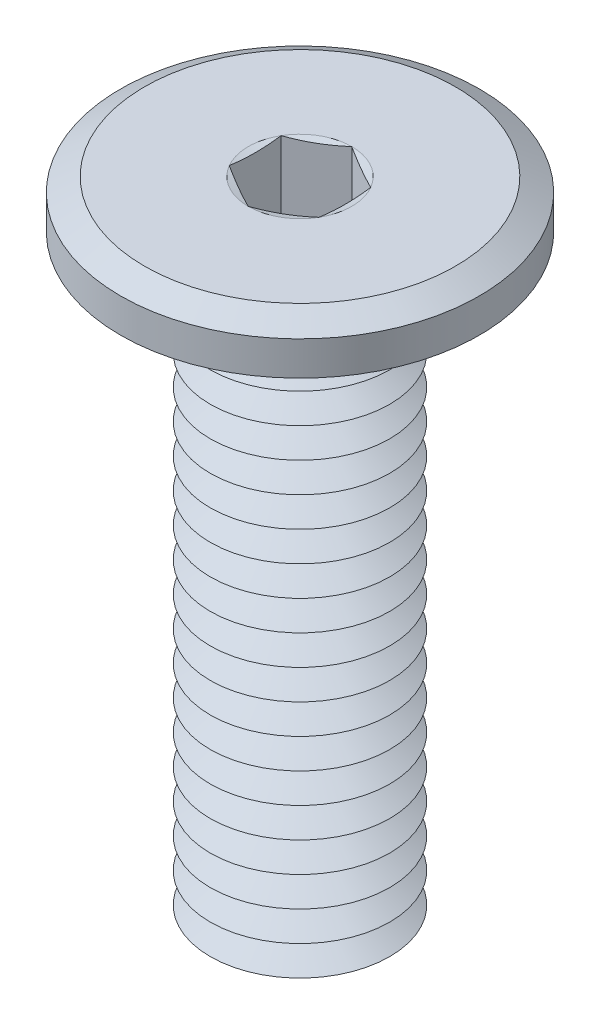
ISO-10303-21;
HEADER;
FILE_DESCRIPTION(('STEP AP214'),'2;1');
FILE_NAME('part.step','',(''),(''),'','','');
FILE_SCHEMA(('AUTOMOTIVE_DESIGN { 1 0 10303 214 1 1 1 1 }'));
ENDSEC;
DATA;
#1=APPLICATION_CONTEXT('core data for automotive mechanical design processes');
#2=APPLICATION_PROTOCOL_DEFINITION('international standard','automotive_design',2000,#1);
#3=PRODUCT_CONTEXT('',#1,'mechanical');
#4=PRODUCT('Part','Part','',(#3));
#5=PRODUCT_RELATED_PRODUCT_CATEGORY('part','',(#4));
#6=PRODUCT_DEFINITION_FORMATION('','',#4);
#7=PRODUCT_DEFINITION_CONTEXT('part definition',#1,'design');
#8=PRODUCT_DEFINITION('design','',#6,#7);
#9=PRODUCT_DEFINITION_SHAPE('','',#8);
#10=(LENGTH_UNIT() NAMED_UNIT(*) SI_UNIT(.MILLI.,.METRE.));
#11=(NAMED_UNIT(*) PLANE_ANGLE_UNIT() SI_UNIT($,.RADIAN.));
#12=(NAMED_UNIT(*) SI_UNIT($,.STERADIAN.) SOLID_ANGLE_UNIT());
#13=UNCERTAINTY_MEASURE_WITH_UNIT(LENGTH_MEASURE(1.E-05),#10,'distance_accuracy_value','');
#14=(GEOMETRIC_REPRESENTATION_CONTEXT(3) GLOBAL_UNCERTAINTY_ASSIGNED_CONTEXT((#13)) GLOBAL_UNIT_ASSIGNED_CONTEXT((#10,
#11,#12)) REPRESENTATION_CONTEXT('',''));
#15=CARTESIAN_POINT('',(0.,0.,0.));
#16=DIRECTION('',(0.,0.,1.));
#17=DIRECTION('',(1.,0.,0.));
#18=AXIS2_PLACEMENT_3D('',#15,#16,#17);
#19=CARTESIAN_POINT('',(0.,-10.05,0.));
#20=DIRECTION('',(0.,-1.,0.));
#21=DIRECTION('',(0.,0.,-1.));
#22=AXIS2_PLACEMENT_3D('',#19,#20,#21);
#23=CONICAL_SURFACE('',#22,1.5,1.0471975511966);
#24=CARTESIAN_POINT('',(0.,-9.8,0.));
#25=DIRECTION('',(0.,1.,0.));
#26=DIRECTION('',(0.,0.,1.));
#27=AXIS2_PLACEMENT_3D('',#24,#25,#26);
#28=CIRCLE('',#27,1.06698729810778);
#29=CARTESIAN_POINT('',(0.,-9.8,1.06698729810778));
#30=VERTEX_POINT('',#29);
#31=EDGE_CURVE('E505',#30,#30,#28,.T.);
#32=ORIENTED_EDGE('',*,*,#31,.F.);
#33=EDGE_LOOP('',(#32));
#34=FACE_BOUND('',#33,.T.);
#35=CARTESIAN_POINT('',(0.,-10.05,0.));
#36=DIRECTION('',(0.,1.,0.));
#37=DIRECTION('',(0.,0.,1.));
#38=AXIS2_PLACEMENT_3D('',#35,#36,#37);
#39=CIRCLE('',#38,1.5);
#40=CARTESIAN_POINT('',(0.,-10.05,1.5));
#41=VERTEX_POINT('',#40);
#42=EDGE_CURVE('E509',#41,#41,#39,.T.);
#43=ORIENTED_EDGE('',*,*,#42,.T.);
#44=EDGE_LOOP('',(#43));
#45=FACE_BOUND('',#44,.T.);
#46=ADVANCED_FACE('F39',(#34,#45),#23,.T.);
#47=CARTESIAN_POINT('',(0.,-9.8,0.));
#48=DIRECTION('',(0.,1.,0.));
#49=DIRECTION('',(0.,0.,1.));
#50=AXIS2_PLACEMENT_3D('',#47,#48,#49);
#51=CONICAL_SURFACE('',#50,1.06698729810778,1.0471975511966);
#52=CARTESIAN_POINT('',(0.,-9.55,0.));
#53=DIRECTION('',(0.,1.,0.));
#54=DIRECTION('',(0.,0.,1.));
#55=AXIS2_PLACEMENT_3D('',#52,#53,#54);
#56=CIRCLE('',#55,1.5);
#57=CARTESIAN_POINT('',(0.,-9.55,1.5));
#58=VERTEX_POINT('',#57);
#59=EDGE_CURVE('E501',#58,#58,#56,.T.);
#60=ORIENTED_EDGE('',*,*,#59,.F.);
#61=EDGE_LOOP('',(#60));
#62=FACE_BOUND('',#61,.T.);
#63=ORIENTED_EDGE('',*,*,#31,.T.);
#64=EDGE_LOOP('',(#63));
#65=FACE_BOUND('',#64,.T.);
#66=ADVANCED_FACE('F232',(#62,#65),#51,.T.);
#67=CARTESIAN_POINT('',(0.,-10.8,0.));
#68=DIRECTION('',(0.,-1.,0.));
#69=DIRECTION('',(0.,0.,-1.));
#70=AXIS2_PLACEMENT_3D('',#67,#68,#69);
#71=PLANE('',#70);
#72=CARTESIAN_POINT('',(0.,-10.8,0.));
#73=DIRECTION('',(0.,1.,0.));
#74=DIRECTION('',(0.,0.,1.));
#75=AXIS2_PLACEMENT_3D('',#72,#73,#74);
#76=CIRCLE('',#75,1.06698729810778);
#77=CARTESIAN_POINT('',(0.,-10.8,1.06698729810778));
#78=VERTEX_POINT('',#77);
#79=EDGE_CURVE('E299',#78,#78,#76,.T.);
#80=ORIENTED_EDGE('',*,*,#79,.F.);
#81=EDGE_LOOP('',(#80));
#82=FACE_BOUND('',#81,.T.);
#83=ADVANCED_FACE('F238',(#82),#71,.T.);
#84=CARTESIAN_POINT('',(0.,-10.8,0.));
#85=DIRECTION('',(0.,1.,0.));
#86=DIRECTION('',(0.,0.,1.));
#87=AXIS2_PLACEMENT_3D('',#84,#85,#86);
#88=CONICAL_SURFACE('',#87,1.06698729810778,1.0471975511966);
#89=CARTESIAN_POINT('',(0.,-10.55,0.));
#90=DIRECTION('',(0.,1.,0.));
#91=DIRECTION('',(0.,0.,1.));
#92=AXIS2_PLACEMENT_3D('',#89,#90,#91);
#93=CIRCLE('',#92,1.5);
#94=CARTESIAN_POINT('',(0.,-10.55,1.5));
#95=VERTEX_POINT('',#94);
#96=EDGE_CURVE('E517',#95,#95,#93,.T.);
#97=ORIENTED_EDGE('',*,*,#96,.F.);
#98=EDGE_LOOP('',(#97));
#99=FACE_BOUND('',#98,.T.);
#100=ORIENTED_EDGE('',*,*,#79,.T.);
#101=EDGE_LOOP('',(#100));
#102=FACE_BOUND('',#101,.T.);
#103=ADVANCED_FACE('F253',(#99,#102),#88,.T.);
#104=CARTESIAN_POINT('',(0.,-10.55,0.));
#105=DIRECTION('',(0.,-1.,0.));
#106=DIRECTION('',(0.,0.,-1.));
#107=AXIS2_PLACEMENT_3D('',#104,#105,#106);
#108=CONICAL_SURFACE('',#107,1.5,1.0471975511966);
#109=CARTESIAN_POINT('',(0.,-10.3,0.));
#110=DIRECTION('',(0.,1.,0.));
#111=DIRECTION('',(0.,0.,1.));
#112=AXIS2_PLACEMENT_3D('',#109,#110,#111);
#113=CIRCLE('',#112,1.06698729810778);
#114=CARTESIAN_POINT('',(0.,-10.3,1.06698729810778));
#115=VERTEX_POINT('',#114);
#116=EDGE_CURVE('E513',#115,#115,#113,.T.);
#117=ORIENTED_EDGE('',*,*,#116,.F.);
#118=EDGE_LOOP('',(#117));
#119=FACE_BOUND('',#118,.T.);
#120=ORIENTED_EDGE('',*,*,#96,.T.);
#121=EDGE_LOOP('',(#120));
#122=FACE_BOUND('',#121,.T.);
#123=ADVANCED_FACE('F249',(#119,#122),#108,.T.);
#124=CARTESIAN_POINT('',(0.,-10.3,0.));
#125=DIRECTION('',(0.,1.,0.));
#126=DIRECTION('',(0.,0.,1.));
#127=AXIS2_PLACEMENT_3D('',#124,#125,#126);
#128=CONICAL_SURFACE('',#127,1.06698729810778,1.0471975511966);
#129=ORIENTED_EDGE('',*,*,#42,.F.);
#130=EDGE_LOOP('',(#129));
#131=FACE_BOUND('',#130,.T.);
#132=ORIENTED_EDGE('',*,*,#116,.T.);
#133=EDGE_LOOP('',(#132));
#134=FACE_BOUND('',#133,.T.);
#135=ADVANCED_FACE('F245',(#131,#134),#128,.T.);
#136=CARTESIAN_POINT('',(0.,-9.55,0.));
#137=DIRECTION('',(0.,-1.,0.));
#138=DIRECTION('',(0.,0.,-1.));
#139=AXIS2_PLACEMENT_3D('',#136,#137,#138);
#140=CONICAL_SURFACE('',#139,1.5,1.0471975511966);
#141=CARTESIAN_POINT('',(0.,-9.3,0.));
#142=DIRECTION('',(0.,1.,0.));
#143=DIRECTION('',(0.,0.,1.));
#144=AXIS2_PLACEMENT_3D('',#141,#142,#143);
#145=CIRCLE('',#144,1.06698729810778);
#146=CARTESIAN_POINT('',(0.,-9.3,1.06698729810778));
#147=VERTEX_POINT('',#146);
#148=EDGE_CURVE('E497',#147,#147,#145,.T.);
#149=ORIENTED_EDGE('',*,*,#148,.F.);
#150=EDGE_LOOP('',(#149));
#151=FACE_BOUND('',#150,.T.);
#152=ORIENTED_EDGE('',*,*,#59,.T.);
#153=EDGE_LOOP('',(#152));
#154=FACE_BOUND('',#153,.T.);
#155=ADVANCED_FACE('F248',(#151,#154),#140,.T.);
#156=CARTESIAN_POINT('',(0.,-9.3,0.));
#157=DIRECTION('',(0.,1.,0.));
#158=DIRECTION('',(0.,0.,1.));
#159=AXIS2_PLACEMENT_3D('',#156,#157,#158);
#160=CONICAL_SURFACE('',#159,1.06698729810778,1.0471975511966);
#161=CARTESIAN_POINT('',(0.,-9.05,0.));
#162=DIRECTION('',(0.,1.,0.));
#163=DIRECTION('',(0.,0.,1.));
#164=AXIS2_PLACEMENT_3D('',#161,#162,#163);
#165=CIRCLE('',#164,1.5);
#166=CARTESIAN_POINT('',(0.,-9.05,1.5));
#167=VERTEX_POINT('',#166);
#168=EDGE_CURVE('E493',#167,#167,#165,.T.);
#169=ORIENTED_EDGE('',*,*,#168,.F.);
#170=EDGE_LOOP('',(#169));
#171=FACE_BOUND('',#170,.T.);
#172=ORIENTED_EDGE('',*,*,#148,.T.);
#173=EDGE_LOOP('',(#172));
#174=FACE_BOUND('',#173,.T.);
#175=ADVANCED_FACE('F887',(#171,#174),#160,.T.);
#176=CARTESIAN_POINT('',(0.,-9.05,0.));
#177=DIRECTION('',(0.,-1.,0.));
#178=DIRECTION('',(0.,0.,-1.));
#179=AXIS2_PLACEMENT_3D('',#176,#177,#178);
#180=CONICAL_SURFACE('',#179,1.5,1.0471975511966);
#181=CARTESIAN_POINT('',(0.,-8.8,0.));
#182=DIRECTION('',(0.,1.,0.));
#183=DIRECTION('',(0.,0.,1.));
#184=AXIS2_PLACEMENT_3D('',#181,#182,#183);
#185=CIRCLE('',#184,1.06698729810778);
#186=CARTESIAN_POINT('',(0.,-8.8,1.06698729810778));
#187=VERTEX_POINT('',#186);
#188=EDGE_CURVE('E490',#187,#187,#185,.T.);
#189=ORIENTED_EDGE('',*,*,#188,.F.);
#190=EDGE_LOOP('',(#189));
#191=FACE_BOUND('',#190,.T.);
#192=ORIENTED_EDGE('',*,*,#168,.T.);
#193=EDGE_LOOP('',(#192));
#194=FACE_BOUND('',#193,.T.);
#195=ADVANCED_FACE('F878',(#191,#194),#180,.T.);
#196=CARTESIAN_POINT('',(0.,-8.8,0.));
#197=DIRECTION('',(0.,1.,0.));
#198=DIRECTION('',(0.,0.,1.));
#199=AXIS2_PLACEMENT_3D('',#196,#197,#198);
#200=CONICAL_SURFACE('',#199,1.06698729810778,1.0471975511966);
#201=CARTESIAN_POINT('',(0.,-8.55,0.));
#202=DIRECTION('',(0.,1.,0.));
#203=DIRECTION('',(0.,0.,1.));
#204=AXIS2_PLACEMENT_3D('',#201,#202,#203);
#205=CIRCLE('',#204,1.5);
#206=CARTESIAN_POINT('',(0.,-8.55,1.5));
#207=VERTEX_POINT('',#206);
#208=EDGE_CURVE('E486',#207,#207,#205,.T.);
#209=ORIENTED_EDGE('',*,*,#208,.F.);
#210=EDGE_LOOP('',(#209));
#211=FACE_BOUND('',#210,.T.);
#212=ORIENTED_EDGE('',*,*,#188,.T.);
#213=EDGE_LOOP('',(#212));
#214=FACE_BOUND('',#213,.T.);
#215=ADVANCED_FACE('F869',(#211,#214),#200,.T.);
#216=CARTESIAN_POINT('',(0.,-8.55,0.));
#217=DIRECTION('',(0.,-1.,0.));
#218=DIRECTION('',(0.,0.,-1.));
#219=AXIS2_PLACEMENT_3D('',#216,#217,#218);
#220=CONICAL_SURFACE('',#219,1.5,1.0471975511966);
#221=CARTESIAN_POINT('',(0.,-8.3,0.));
#222=DIRECTION('',(0.,1.,0.));
#223=DIRECTION('',(0.,0.,1.));
#224=AXIS2_PLACEMENT_3D('',#221,#222,#223);
#225=CIRCLE('',#224,1.06698729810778);
#226=CARTESIAN_POINT('',(0.,-8.3,1.06698729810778));
#227=VERTEX_POINT('',#226);
#228=EDGE_CURVE('E482',#227,#227,#225,.T.);
#229=ORIENTED_EDGE('',*,*,#228,.F.);
#230=EDGE_LOOP('',(#229));
#231=FACE_BOUND('',#230,.T.);
#232=ORIENTED_EDGE('',*,*,#208,.T.);
#233=EDGE_LOOP('',(#232));
#234=FACE_BOUND('',#233,.T.);
#235=ADVANCED_FACE('F860',(#231,#234),#220,.T.);
#236=CARTESIAN_POINT('',(0.,-8.3,0.));
#237=DIRECTION('',(0.,1.,0.));
#238=DIRECTION('',(0.,0.,1.));
#239=AXIS2_PLACEMENT_3D('',#236,#237,#238);
#240=CONICAL_SURFACE('',#239,1.06698729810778,1.0471975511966);
#241=CARTESIAN_POINT('',(0.,-8.05,0.));
#242=DIRECTION('',(0.,1.,0.));
#243=DIRECTION('',(0.,0.,1.));
#244=AXIS2_PLACEMENT_3D('',#241,#242,#243);
#245=CIRCLE('',#244,1.5);
#246=CARTESIAN_POINT('',(0.,-8.05,1.5));
#247=VERTEX_POINT('',#246);
#248=EDGE_CURVE('E479',#247,#247,#245,.T.);
#249=ORIENTED_EDGE('',*,*,#248,.F.);
#250=EDGE_LOOP('',(#249));
#251=FACE_BOUND('',#250,.T.);
#252=ORIENTED_EDGE('',*,*,#228,.T.);
#253=EDGE_LOOP('',(#252));
#254=FACE_BOUND('',#253,.T.);
#255=ADVANCED_FACE('F851',(#251,#254),#240,.T.);
#256=CARTESIAN_POINT('',(0.,-8.05,0.));
#257=DIRECTION('',(0.,-1.,0.));
#258=DIRECTION('',(0.,0.,-1.));
#259=AXIS2_PLACEMENT_3D('',#256,#257,#258);
#260=CONICAL_SURFACE('',#259,1.5,1.0471975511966);
#261=CARTESIAN_POINT('',(0.,-7.8,0.));
#262=DIRECTION('',(0.,1.,0.));
#263=DIRECTION('',(0.,0.,1.));
#264=AXIS2_PLACEMENT_3D('',#261,#262,#263);
#265=CIRCLE('',#264,1.06698729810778);
#266=CARTESIAN_POINT('',(0.,-7.8,1.06698729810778));
#267=VERTEX_POINT('',#266);
#268=EDGE_CURVE('E476',#267,#267,#265,.T.);
#269=ORIENTED_EDGE('',*,*,#268,.F.);
#270=EDGE_LOOP('',(#269));
#271=FACE_BOUND('',#270,.T.);
#272=ORIENTED_EDGE('',*,*,#248,.T.);
#273=EDGE_LOOP('',(#272));
#274=FACE_BOUND('',#273,.T.);
#275=ADVANCED_FACE('F842',(#271,#274),#260,.T.);
#276=CARTESIAN_POINT('',(0.,-7.8,0.));
#277=DIRECTION('',(0.,1.,0.));
#278=DIRECTION('',(0.,0.,1.));
#279=AXIS2_PLACEMENT_3D('',#276,#277,#278);
#280=CONICAL_SURFACE('',#279,1.06698729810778,1.0471975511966);
#281=CARTESIAN_POINT('',(0.,-7.55,0.));
#282=DIRECTION('',(0.,1.,0.));
#283=DIRECTION('',(0.,0.,1.));
#284=AXIS2_PLACEMENT_3D('',#281,#282,#283);
#285=CIRCLE('',#284,1.5);
#286=CARTESIAN_POINT('',(0.,-7.55,1.5));
#287=VERTEX_POINT('',#286);
#288=EDGE_CURVE('E472',#287,#287,#285,.T.);
#289=ORIENTED_EDGE('',*,*,#288,.F.);
#290=EDGE_LOOP('',(#289));
#291=FACE_BOUND('',#290,.T.);
#292=ORIENTED_EDGE('',*,*,#268,.T.);
#293=EDGE_LOOP('',(#292));
#294=FACE_BOUND('',#293,.T.);
#295=ADVANCED_FACE('F833',(#291,#294),#280,.T.);
#296=CARTESIAN_POINT('',(0.,-7.55,0.));
#297=DIRECTION('',(0.,-1.,0.));
#298=DIRECTION('',(0.,0.,-1.));
#299=AXIS2_PLACEMENT_3D('',#296,#297,#298);
#300=CONICAL_SURFACE('',#299,1.5,1.0471975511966);
#301=CARTESIAN_POINT('',(0.,-7.3,0.));
#302=DIRECTION('',(0.,1.,0.));
#303=DIRECTION('',(0.,0.,1.));
#304=AXIS2_PLACEMENT_3D('',#301,#302,#303);
#305=CIRCLE('',#304,1.06698729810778);
#306=CARTESIAN_POINT('',(0.,-7.3,1.06698729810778));
#307=VERTEX_POINT('',#306);
#308=EDGE_CURVE('E468',#307,#307,#305,.T.);
#309=ORIENTED_EDGE('',*,*,#308,.F.);
#310=EDGE_LOOP('',(#309));
#311=FACE_BOUND('',#310,.T.);
#312=ORIENTED_EDGE('',*,*,#288,.T.);
#313=EDGE_LOOP('',(#312));
#314=FACE_BOUND('',#313,.T.);
#315=ADVANCED_FACE('F824',(#311,#314),#300,.T.);
#316=CARTESIAN_POINT('',(0.,-7.3,0.));
#317=DIRECTION('',(0.,1.,0.));
#318=DIRECTION('',(0.,0.,1.));
#319=AXIS2_PLACEMENT_3D('',#316,#317,#318);
#320=CONICAL_SURFACE('',#319,1.06698729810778,1.0471975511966);
#321=CARTESIAN_POINT('',(0.,-7.05,0.));
#322=DIRECTION('',(0.,1.,0.));
#323=DIRECTION('',(0.,0.,1.));
#324=AXIS2_PLACEMENT_3D('',#321,#322,#323);
#325=CIRCLE('',#324,1.5);
#326=CARTESIAN_POINT('',(0.,-7.05,1.5));
#327=VERTEX_POINT('',#326);
#328=EDGE_CURVE('E464',#327,#327,#325,.T.);
#329=ORIENTED_EDGE('',*,*,#328,.F.);
#330=EDGE_LOOP('',(#329));
#331=FACE_BOUND('',#330,.T.);
#332=ORIENTED_EDGE('',*,*,#308,.T.);
#333=EDGE_LOOP('',(#332));
#334=FACE_BOUND('',#333,.T.);
#335=ADVANCED_FACE('F815',(#331,#334),#320,.T.);
#336=CARTESIAN_POINT('',(0.,-7.05,0.));
#337=DIRECTION('',(0.,-1.,0.));
#338=DIRECTION('',(0.,0.,-1.));
#339=AXIS2_PLACEMENT_3D('',#336,#337,#338);
#340=CONICAL_SURFACE('',#339,1.5,1.0471975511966);
#341=CARTESIAN_POINT('',(0.,-6.8,0.));
#342=DIRECTION('',(0.,1.,0.));
#343=DIRECTION('',(0.,0.,1.));
#344=AXIS2_PLACEMENT_3D('',#341,#342,#343);
#345=CIRCLE('',#344,1.06698729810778);
#346=CARTESIAN_POINT('',(0.,-6.8,1.06698729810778));
#347=VERTEX_POINT('',#346);
#348=EDGE_CURVE('E460',#347,#347,#345,.T.);
#349=ORIENTED_EDGE('',*,*,#348,.F.);
#350=EDGE_LOOP('',(#349));
#351=FACE_BOUND('',#350,.T.);
#352=ORIENTED_EDGE('',*,*,#328,.T.);
#353=EDGE_LOOP('',(#352));
#354=FACE_BOUND('',#353,.T.);
#355=ADVANCED_FACE('F806',(#351,#354),#340,.T.);
#356=CARTESIAN_POINT('',(0.,-6.8,0.));
#357=DIRECTION('',(0.,1.,0.));
#358=DIRECTION('',(0.,0.,1.));
#359=AXIS2_PLACEMENT_3D('',#356,#357,#358);
#360=CONICAL_SURFACE('',#359,1.06698729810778,1.0471975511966);
#361=CARTESIAN_POINT('',(0.,-6.55,0.));
#362=DIRECTION('',(0.,1.,0.));
#363=DIRECTION('',(0.,0.,1.));
#364=AXIS2_PLACEMENT_3D('',#361,#362,#363);
#365=CIRCLE('',#364,1.5);
#366=CARTESIAN_POINT('',(0.,-6.55,1.5));
#367=VERTEX_POINT('',#366);
#368=EDGE_CURVE('E456',#367,#367,#365,.T.);
#369=ORIENTED_EDGE('',*,*,#368,.F.);
#370=EDGE_LOOP('',(#369));
#371=FACE_BOUND('',#370,.T.);
#372=ORIENTED_EDGE('',*,*,#348,.T.);
#373=EDGE_LOOP('',(#372));
#374=FACE_BOUND('',#373,.T.);
#375=ADVANCED_FACE('F797',(#371,#374),#360,.T.);
#376=CARTESIAN_POINT('',(0.,-6.55,0.));
#377=DIRECTION('',(0.,-1.,0.));
#378=DIRECTION('',(0.,0.,-1.));
#379=AXIS2_PLACEMENT_3D('',#376,#377,#378);
#380=CONICAL_SURFACE('',#379,1.5,1.0471975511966);
#381=CARTESIAN_POINT('',(0.,-6.3,0.));
#382=DIRECTION('',(0.,1.,0.));
#383=DIRECTION('',(0.,0.,1.));
#384=AXIS2_PLACEMENT_3D('',#381,#382,#383);
#385=CIRCLE('',#384,1.06698729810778);
#386=CARTESIAN_POINT('',(0.,-6.3,1.06698729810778));
#387=VERTEX_POINT('',#386);
#388=EDGE_CURVE('E452',#387,#387,#385,.T.);
#389=ORIENTED_EDGE('',*,*,#388,.F.);
#390=EDGE_LOOP('',(#389));
#391=FACE_BOUND('',#390,.T.);
#392=ORIENTED_EDGE('',*,*,#368,.T.);
#393=EDGE_LOOP('',(#392));
#394=FACE_BOUND('',#393,.T.);
#395=ADVANCED_FACE('F788',(#391,#394),#380,.T.);
#396=CARTESIAN_POINT('',(0.,-6.3,0.));
#397=DIRECTION('',(0.,1.,0.));
#398=DIRECTION('',(0.,0.,1.));
#399=AXIS2_PLACEMENT_3D('',#396,#397,#398);
#400=CONICAL_SURFACE('',#399,1.06698729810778,1.0471975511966);
#401=CARTESIAN_POINT('',(0.,-6.05,0.));
#402=DIRECTION('',(0.,1.,0.));
#403=DIRECTION('',(0.,0.,1.));
#404=AXIS2_PLACEMENT_3D('',#401,#402,#403);
#405=CIRCLE('',#404,1.5);
#406=CARTESIAN_POINT('',(0.,-6.05,1.5));
#407=VERTEX_POINT('',#406);
#408=EDGE_CURVE('E449',#407,#407,#405,.T.);
#409=ORIENTED_EDGE('',*,*,#408,.F.);
#410=EDGE_LOOP('',(#409));
#411=FACE_BOUND('',#410,.T.);
#412=ORIENTED_EDGE('',*,*,#388,.T.);
#413=EDGE_LOOP('',(#412));
#414=FACE_BOUND('',#413,.T.);
#415=ADVANCED_FACE('F779',(#411,#414),#400,.T.);
#416=CARTESIAN_POINT('',(0.,-6.05,0.));
#417=DIRECTION('',(0.,-1.,0.));
#418=DIRECTION('',(0.,0.,-1.));
#419=AXIS2_PLACEMENT_3D('',#416,#417,#418);
#420=CONICAL_SURFACE('',#419,1.5,1.0471975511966);
#421=CARTESIAN_POINT('',(0.,-5.8,0.));
#422=DIRECTION('',(0.,1.,0.));
#423=DIRECTION('',(0.,0.,1.));
#424=AXIS2_PLACEMENT_3D('',#421,#422,#423);
#425=CIRCLE('',#424,1.06698729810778);
#426=CARTESIAN_POINT('',(0.,-5.8,1.06698729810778));
#427=VERTEX_POINT('',#426);
#428=EDGE_CURVE('E445',#427,#427,#425,.T.);
#429=ORIENTED_EDGE('',*,*,#428,.F.);
#430=EDGE_LOOP('',(#429));
#431=FACE_BOUND('',#430,.T.);
#432=ORIENTED_EDGE('',*,*,#408,.T.);
#433=EDGE_LOOP('',(#432));
#434=FACE_BOUND('',#433,.T.);
#435=ADVANCED_FACE('F770',(#431,#434),#420,.T.);
#436=CARTESIAN_POINT('',(0.,-5.8,0.));
#437=DIRECTION('',(0.,1.,0.));
#438=DIRECTION('',(0.,0.,1.));
#439=AXIS2_PLACEMENT_3D('',#436,#437,#438);
#440=CONICAL_SURFACE('',#439,1.06698729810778,1.0471975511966);
#441=CARTESIAN_POINT('',(0.,-5.55,0.));
#442=DIRECTION('',(0.,1.,0.));
#443=DIRECTION('',(0.,0.,1.));
#444=AXIS2_PLACEMENT_3D('',#441,#442,#443);
#445=CIRCLE('',#444,1.5);
#446=CARTESIAN_POINT('',(0.,-5.55,1.5));
#447=VERTEX_POINT('',#446);
#448=EDGE_CURVE('E442',#447,#447,#445,.T.);
#449=ORIENTED_EDGE('',*,*,#448,.F.);
#450=EDGE_LOOP('',(#449));
#451=FACE_BOUND('',#450,.T.);
#452=ORIENTED_EDGE('',*,*,#428,.T.);
#453=EDGE_LOOP('',(#452));
#454=FACE_BOUND('',#453,.T.);
#455=ADVANCED_FACE('F761',(#451,#454),#440,.T.);
#456=CARTESIAN_POINT('',(0.,-5.55,0.));
#457=DIRECTION('',(0.,-1.,0.));
#458=DIRECTION('',(0.,0.,-1.));
#459=AXIS2_PLACEMENT_3D('',#456,#457,#458);
#460=CONICAL_SURFACE('',#459,1.5,1.0471975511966);
#461=CARTESIAN_POINT('',(0.,-5.3,0.));
#462=DIRECTION('',(0.,1.,0.));
#463=DIRECTION('',(0.,0.,1.));
#464=AXIS2_PLACEMENT_3D('',#461,#462,#463);
#465=CIRCLE('',#464,1.06698729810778);
#466=CARTESIAN_POINT('',(0.,-5.3,1.06698729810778));
#467=VERTEX_POINT('',#466);
#468=EDGE_CURVE('E438',#467,#467,#465,.T.);
#469=ORIENTED_EDGE('',*,*,#468,.F.);
#470=EDGE_LOOP('',(#469));
#471=FACE_BOUND('',#470,.T.);
#472=ORIENTED_EDGE('',*,*,#448,.T.);
#473=EDGE_LOOP('',(#472));
#474=FACE_BOUND('',#473,.T.);
#475=ADVANCED_FACE('F752',(#471,#474),#460,.T.);
#476=CARTESIAN_POINT('',(0.,-5.3,0.));
#477=DIRECTION('',(0.,1.,0.));
#478=DIRECTION('',(0.,0.,1.));
#479=AXIS2_PLACEMENT_3D('',#476,#477,#478);
#480=CONICAL_SURFACE('',#479,1.06698729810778,1.0471975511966);
#481=CARTESIAN_POINT('',(0.,-5.05,0.));
#482=DIRECTION('',(0.,1.,0.));
#483=DIRECTION('',(0.,0.,1.));
#484=AXIS2_PLACEMENT_3D('',#481,#482,#483);
#485=CIRCLE('',#484,1.5);
#486=CARTESIAN_POINT('',(0.,-5.05,1.5));
#487=VERTEX_POINT('',#486);
#488=EDGE_CURVE('E434',#487,#487,#485,.T.);
#489=ORIENTED_EDGE('',*,*,#488,.F.);
#490=EDGE_LOOP('',(#489));
#491=FACE_BOUND('',#490,.T.);
#492=ORIENTED_EDGE('',*,*,#468,.T.);
#493=EDGE_LOOP('',(#492));
#494=FACE_BOUND('',#493,.T.);
#495=ADVANCED_FACE('F743',(#491,#494),#480,.T.);
#496=CARTESIAN_POINT('',(0.,-5.05,0.));
#497=DIRECTION('',(0.,-1.,0.));
#498=DIRECTION('',(0.,0.,-1.));
#499=AXIS2_PLACEMENT_3D('',#496,#497,#498);
#500=CONICAL_SURFACE('',#499,1.5,1.0471975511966);
#501=CARTESIAN_POINT('',(0.,-4.8,0.));
#502=DIRECTION('',(0.,1.,0.));
#503=DIRECTION('',(0.,0.,1.));
#504=AXIS2_PLACEMENT_3D('',#501,#502,#503);
#505=CIRCLE('',#504,1.06698729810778);
#506=CARTESIAN_POINT('',(0.,-4.8,1.06698729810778));
#507=VERTEX_POINT('',#506);
#508=EDGE_CURVE('E430',#507,#507,#505,.T.);
#509=ORIENTED_EDGE('',*,*,#508,.F.);
#510=EDGE_LOOP('',(#509));
#511=FACE_BOUND('',#510,.T.);
#512=ORIENTED_EDGE('',*,*,#488,.T.);
#513=EDGE_LOOP('',(#512));
#514=FACE_BOUND('',#513,.T.);
#515=ADVANCED_FACE('F734',(#511,#514),#500,.T.);
#516=CARTESIAN_POINT('',(0.,-4.8,0.));
#517=DIRECTION('',(0.,1.,0.));
#518=DIRECTION('',(0.,0.,1.));
#519=AXIS2_PLACEMENT_3D('',#516,#517,#518);
#520=CONICAL_SURFACE('',#519,1.06698729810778,1.0471975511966);
#521=CARTESIAN_POINT('',(0.,-4.55,0.));
#522=DIRECTION('',(0.,1.,0.));
#523=DIRECTION('',(0.,0.,1.));
#524=AXIS2_PLACEMENT_3D('',#521,#522,#523);
#525=CIRCLE('',#524,1.5);
#526=CARTESIAN_POINT('',(0.,-4.55,1.5));
#527=VERTEX_POINT('',#526);
#528=EDGE_CURVE('E426',#527,#527,#525,.T.);
#529=ORIENTED_EDGE('',*,*,#528,.F.);
#530=EDGE_LOOP('',(#529));
#531=FACE_BOUND('',#530,.T.);
#532=ORIENTED_EDGE('',*,*,#508,.T.);
#533=EDGE_LOOP('',(#532));
#534=FACE_BOUND('',#533,.T.);
#535=ADVANCED_FACE('F725',(#531,#534),#520,.T.);
#536=CARTESIAN_POINT('',(0.,-4.55,0.));
#537=DIRECTION('',(0.,-1.,0.));
#538=DIRECTION('',(0.,0.,-1.));
#539=AXIS2_PLACEMENT_3D('',#536,#537,#538);
#540=CONICAL_SURFACE('',#539,1.5,1.0471975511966);
#541=CARTESIAN_POINT('',(0.,-4.3,0.));
#542=DIRECTION('',(0.,1.,0.));
#543=DIRECTION('',(0.,0.,1.));
#544=AXIS2_PLACEMENT_3D('',#541,#542,#543);
#545=CIRCLE('',#544,1.06698729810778);
#546=CARTESIAN_POINT('',(0.,-4.3,1.06698729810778));
#547=VERTEX_POINT('',#546);
#548=EDGE_CURVE('E422',#547,#547,#545,.T.);
#549=ORIENTED_EDGE('',*,*,#548,.F.);
#550=EDGE_LOOP('',(#549));
#551=FACE_BOUND('',#550,.T.);
#552=ORIENTED_EDGE('',*,*,#528,.T.);
#553=EDGE_LOOP('',(#552));
#554=FACE_BOUND('',#553,.T.);
#555=ADVANCED_FACE('F716',(#551,#554),#540,.T.);
#556=CARTESIAN_POINT('',(0.,-4.3,0.));
#557=DIRECTION('',(0.,1.,0.));
#558=DIRECTION('',(0.,0.,1.));
#559=AXIS2_PLACEMENT_3D('',#556,#557,#558);
#560=CONICAL_SURFACE('',#559,1.06698729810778,1.0471975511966);
#561=CARTESIAN_POINT('',(0.,-4.05,0.));
#562=DIRECTION('',(0.,1.,0.));
#563=DIRECTION('',(0.,0.,1.));
#564=AXIS2_PLACEMENT_3D('',#561,#562,#563);
#565=CIRCLE('',#564,1.5);
#566=CARTESIAN_POINT('',(0.,-4.05,1.5));
#567=VERTEX_POINT('',#566);
#568=EDGE_CURVE('E418',#567,#567,#565,.T.);
#569=ORIENTED_EDGE('',*,*,#568,.F.);
#570=EDGE_LOOP('',(#569));
#571=FACE_BOUND('',#570,.T.);
#572=ORIENTED_EDGE('',*,*,#548,.T.);
#573=EDGE_LOOP('',(#572));
#574=FACE_BOUND('',#573,.T.);
#575=ADVANCED_FACE('F707',(#571,#574),#560,.T.);
#576=CARTESIAN_POINT('',(0.,-4.05,0.));
#577=DIRECTION('',(0.,-1.,0.));
#578=DIRECTION('',(0.,0.,-1.));
#579=AXIS2_PLACEMENT_3D('',#576,#577,#578);
#580=CONICAL_SURFACE('',#579,1.5,1.0471975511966);
#581=CARTESIAN_POINT('',(0.,-3.8,0.));
#582=DIRECTION('',(0.,1.,0.));
#583=DIRECTION('',(0.,0.,1.));
#584=AXIS2_PLACEMENT_3D('',#581,#582,#583);
#585=CIRCLE('',#584,1.06698729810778);
#586=CARTESIAN_POINT('',(0.,-3.8,1.06698729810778));
#587=VERTEX_POINT('',#586);
#588=EDGE_CURVE('E414',#587,#587,#585,.T.);
#589=ORIENTED_EDGE('',*,*,#588,.F.);
#590=EDGE_LOOP('',(#589));
#591=FACE_BOUND('',#590,.T.);
#592=ORIENTED_EDGE('',*,*,#568,.T.);
#593=EDGE_LOOP('',(#592));
#594=FACE_BOUND('',#593,.T.);
#595=ADVANCED_FACE('F698',(#591,#594),#580,.T.);
#596=CARTESIAN_POINT('',(0.,-3.8,0.));
#597=DIRECTION('',(0.,1.,0.));
#598=DIRECTION('',(0.,0.,1.));
#599=AXIS2_PLACEMENT_3D('',#596,#597,#598);
#600=CONICAL_SURFACE('',#599,1.06698729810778,1.0471975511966);
#601=CARTESIAN_POINT('',(0.,-3.55,0.));
#602=DIRECTION('',(0.,1.,0.));
#603=DIRECTION('',(0.,0.,1.));
#604=AXIS2_PLACEMENT_3D('',#601,#602,#603);
#605=CIRCLE('',#604,1.5);
#606=CARTESIAN_POINT('',(0.,-3.55,1.5));
#607=VERTEX_POINT('',#606);
#608=EDGE_CURVE('E410',#607,#607,#605,.T.);
#609=ORIENTED_EDGE('',*,*,#608,.F.);
#610=EDGE_LOOP('',(#609));
#611=FACE_BOUND('',#610,.T.);
#612=ORIENTED_EDGE('',*,*,#588,.T.);
#613=EDGE_LOOP('',(#612));
#614=FACE_BOUND('',#613,.T.);
#615=ADVANCED_FACE('F689',(#611,#614),#600,.T.);
#616=CARTESIAN_POINT('',(0.,-3.55,0.));
#617=DIRECTION('',(0.,-1.,0.));
#618=DIRECTION('',(0.,0.,-1.));
#619=AXIS2_PLACEMENT_3D('',#616,#617,#618);
#620=CONICAL_SURFACE('',#619,1.5,1.0471975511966);
#621=CARTESIAN_POINT('',(0.,-3.3,0.));
#622=DIRECTION('',(0.,1.,0.));
#623=DIRECTION('',(0.,0.,1.));
#624=AXIS2_PLACEMENT_3D('',#621,#622,#623);
#625=CIRCLE('',#624,1.06698729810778);
#626=CARTESIAN_POINT('',(0.,-3.3,1.06698729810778));
#627=VERTEX_POINT('',#626);
#628=EDGE_CURVE('E406',#627,#627,#625,.T.);
#629=ORIENTED_EDGE('',*,*,#628,.F.);
#630=EDGE_LOOP('',(#629));
#631=FACE_BOUND('',#630,.T.);
#632=ORIENTED_EDGE('',*,*,#608,.T.);
#633=EDGE_LOOP('',(#632));
#634=FACE_BOUND('',#633,.T.);
#635=ADVANCED_FACE('F680',(#631,#634),#620,.T.);
#636=CARTESIAN_POINT('',(0.,-3.3,0.));
#637=DIRECTION('',(0.,1.,0.));
#638=DIRECTION('',(0.,0.,1.));
#639=AXIS2_PLACEMENT_3D('',#636,#637,#638);
#640=CONICAL_SURFACE('',#639,1.06698729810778,1.0471975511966);
#641=CARTESIAN_POINT('',(0.,-3.05,0.));
#642=DIRECTION('',(0.,1.,0.));
#643=DIRECTION('',(0.,0.,1.));
#644=AXIS2_PLACEMENT_3D('',#641,#642,#643);
#645=CIRCLE('',#644,1.5);
#646=CARTESIAN_POINT('',(0.,-3.05,1.5));
#647=VERTEX_POINT('',#646);
#648=EDGE_CURVE('E402',#647,#647,#645,.T.);
#649=ORIENTED_EDGE('',*,*,#648,.F.);
#650=EDGE_LOOP('',(#649));
#651=FACE_BOUND('',#650,.T.);
#652=ORIENTED_EDGE('',*,*,#628,.T.);
#653=EDGE_LOOP('',(#652));
#654=FACE_BOUND('',#653,.T.);
#655=ADVANCED_FACE('F671',(#651,#654),#640,.T.);
#656=CARTESIAN_POINT('',(0.,-3.05,0.));
#657=DIRECTION('',(0.,-1.,0.));
#658=DIRECTION('',(0.,0.,-1.));
#659=AXIS2_PLACEMENT_3D('',#656,#657,#658);
#660=CONICAL_SURFACE('',#659,1.5,1.0471975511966);
#661=CARTESIAN_POINT('',(0.,-2.8,0.));
#662=DIRECTION('',(0.,1.,0.));
#663=DIRECTION('',(0.,0.,1.));
#664=AXIS2_PLACEMENT_3D('',#661,#662,#663);
#665=CIRCLE('',#664,1.06698729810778);
#666=CARTESIAN_POINT('',(0.,-2.8,1.06698729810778));
#667=VERTEX_POINT('',#666);
#668=EDGE_CURVE('E398',#667,#667,#665,.T.);
#669=ORIENTED_EDGE('',*,*,#668,.F.);
#670=EDGE_LOOP('',(#669));
#671=FACE_BOUND('',#670,.T.);
#672=ORIENTED_EDGE('',*,*,#648,.T.);
#673=EDGE_LOOP('',(#672));
#674=FACE_BOUND('',#673,.T.);
#675=ADVANCED_FACE('F662',(#671,#674),#660,.T.);
#676=CARTESIAN_POINT('',(0.,-2.8,0.));
#677=DIRECTION('',(0.,1.,0.));
#678=DIRECTION('',(0.,0.,1.));
#679=AXIS2_PLACEMENT_3D('',#676,#677,#678);
#680=CONICAL_SURFACE('',#679,1.06698729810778,1.0471975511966);
#681=CARTESIAN_POINT('',(0.,-2.55,0.));
#682=DIRECTION('',(0.,1.,0.));
#683=DIRECTION('',(0.,0.,1.));
#684=AXIS2_PLACEMENT_3D('',#681,#682,#683);
#685=CIRCLE('',#684,1.5);
#686=CARTESIAN_POINT('',(0.,-2.55,1.5));
#687=VERTEX_POINT('',#686);
#688=EDGE_CURVE('E394',#687,#687,#685,.T.);
#689=ORIENTED_EDGE('',*,*,#688,.F.);
#690=EDGE_LOOP('',(#689));
#691=FACE_BOUND('',#690,.T.);
#692=ORIENTED_EDGE('',*,*,#668,.T.);
#693=EDGE_LOOP('',(#692));
#694=FACE_BOUND('',#693,.T.);
#695=ADVANCED_FACE('F653',(#691,#694),#680,.T.);
#696=CARTESIAN_POINT('',(0.,-2.55,0.));
#697=DIRECTION('',(0.,-1.,0.));
#698=DIRECTION('',(0.,0.,-1.));
#699=AXIS2_PLACEMENT_3D('',#696,#697,#698);
#700=CONICAL_SURFACE('',#699,1.5,1.0471975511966);
#701=CARTESIAN_POINT('',(0.,-2.3,0.));
#702=DIRECTION('',(0.,1.,0.));
#703=DIRECTION('',(0.,0.,1.));
#704=AXIS2_PLACEMENT_3D('',#701,#702,#703);
#705=CIRCLE('',#704,1.06698729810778);
#706=CARTESIAN_POINT('',(0.,-2.3,1.06698729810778));
#707=VERTEX_POINT('',#706);
#708=EDGE_CURVE('E390',#707,#707,#705,.T.);
#709=ORIENTED_EDGE('',*,*,#708,.F.);
#710=EDGE_LOOP('',(#709));
#711=FACE_BOUND('',#710,.T.);
#712=ORIENTED_EDGE('',*,*,#688,.T.);
#713=EDGE_LOOP('',(#712));
#714=FACE_BOUND('',#713,.T.);
#715=ADVANCED_FACE('F644',(#711,#714),#700,.T.);
#716=CARTESIAN_POINT('',(0.,-2.3,0.));
#717=DIRECTION('',(0.,1.,0.));
#718=DIRECTION('',(0.,0.,1.));
#719=AXIS2_PLACEMENT_3D('',#716,#717,#718);
#720=CONICAL_SURFACE('',#719,1.06698729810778,1.0471975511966);
#721=CARTESIAN_POINT('',(0.,-2.05,0.));
#722=DIRECTION('',(0.,1.,0.));
#723=DIRECTION('',(0.,0.,1.));
#724=AXIS2_PLACEMENT_3D('',#721,#722,#723);
#725=CIRCLE('',#724,1.5);
#726=CARTESIAN_POINT('',(0.,-2.05,1.5));
#727=VERTEX_POINT('',#726);
#728=EDGE_CURVE('E386',#727,#727,#725,.T.);
#729=ORIENTED_EDGE('',*,*,#728,.F.);
#730=EDGE_LOOP('',(#729));
#731=FACE_BOUND('',#730,.T.);
#732=ORIENTED_EDGE('',*,*,#708,.T.);
#733=EDGE_LOOP('',(#732));
#734=FACE_BOUND('',#733,.T.);
#735=ADVANCED_FACE('F635',(#731,#734),#720,.T.);
#736=CARTESIAN_POINT('',(0.,-2.05,0.));
#737=DIRECTION('',(0.,-1.,0.));
#738=DIRECTION('',(0.,0.,-1.));
#739=AXIS2_PLACEMENT_3D('',#736,#737,#738);
#740=CONICAL_SURFACE('',#739,1.5,1.0471975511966);
#741=CARTESIAN_POINT('',(0.,-1.8,0.));
#742=DIRECTION('',(0.,1.,0.));
#743=DIRECTION('',(0.,0.,1.));
#744=AXIS2_PLACEMENT_3D('',#741,#742,#743);
#745=CIRCLE('',#744,1.06698729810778);
#746=CARTESIAN_POINT('',(0.,-1.8,1.06698729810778));
#747=VERTEX_POINT('',#746);
#748=EDGE_CURVE('E382',#747,#747,#745,.T.);
#749=ORIENTED_EDGE('',*,*,#748,.F.);
#750=EDGE_LOOP('',(#749));
#751=FACE_BOUND('',#750,.T.);
#752=ORIENTED_EDGE('',*,*,#728,.T.);
#753=EDGE_LOOP('',(#752));
#754=FACE_BOUND('',#753,.T.);
#755=ADVANCED_FACE('F626',(#751,#754),#740,.T.);
#756=CARTESIAN_POINT('',(0.,-1.8,0.));
#757=DIRECTION('',(0.,1.,0.));
#758=DIRECTION('',(0.,0.,1.));
#759=AXIS2_PLACEMENT_3D('',#756,#757,#758);
#760=CONICAL_SURFACE('',#759,1.06698729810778,1.0471975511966);
#761=CARTESIAN_POINT('',(0.,-1.55,0.));
#762=DIRECTION('',(0.,1.,0.));
#763=DIRECTION('',(0.,0.,1.));
#764=AXIS2_PLACEMENT_3D('',#761,#762,#763);
#765=CIRCLE('',#764,1.5);
#766=CARTESIAN_POINT('',(0.,-1.55,1.5));
#767=VERTEX_POINT('',#766);
#768=EDGE_CURVE('E366',#767,#767,#765,.T.);
#769=ORIENTED_EDGE('',*,*,#768,.F.);
#770=EDGE_LOOP('',(#769));
#771=FACE_BOUND('',#770,.T.);
#772=ORIENTED_EDGE('',*,*,#748,.T.);
#773=EDGE_LOOP('',(#772));
#774=FACE_BOUND('',#773,.T.);
#775=ADVANCED_FACE('F273',(#771,#774),#760,.T.);
#776=CARTESIAN_POINT('',(0.,0.,0.));
#777=DIRECTION('',(0.,1.,0.));
#778=DIRECTION('',(0.,0.,1.));
#779=AXIS2_PLACEMENT_3D('',#776,#777,#778);
#780=PLANE('',#779);
#781=CARTESIAN_POINT('',(0.,0.,0.));
#782=DIRECTION('',(0.,1.,0.));
#783=DIRECTION('',(0.,0.,1.));
#784=AXIS2_PLACEMENT_3D('',#781,#782,#783);
#785=CIRCLE('',#784,0.866025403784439);
#786=CARTESIAN_POINT('',(0.,0.,0.866025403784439));
#787=VERTEX_POINT('',#786);
#788=CARTESIAN_POINT('',(0.75,0.,0.43301270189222));
#789=VERTEX_POINT('',#788);
#790=EDGE_CURVE('E66',#787,#789,#785,.T.);
#791=ORIENTED_EDGE('',*,*,#790,.F.);
#792=CARTESIAN_POINT('',(-0.75,0.,0.433012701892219));
#793=VERTEX_POINT('',#792);
#794=EDGE_CURVE('E168',#793,#787,#785,.T.);
#795=ORIENTED_EDGE('',*,*,#794,.F.);
#796=CARTESIAN_POINT('',(-0.75,0.,-0.43301270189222));
#797=VERTEX_POINT('',#796);
#798=EDGE_CURVE('E164',#797,#793,#785,.T.);
#799=ORIENTED_EDGE('',*,*,#798,.F.);
#800=CARTESIAN_POINT('',(0.,0.,-0.866025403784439));
#801=VERTEX_POINT('',#800);
#802=EDGE_CURVE('E128',#801,#797,#785,.T.);
#803=ORIENTED_EDGE('',*,*,#802,.F.);
#804=CARTESIAN_POINT('',(0.75,0.,-0.43301270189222));
#805=VERTEX_POINT('',#804);
#806=EDGE_CURVE('E119',#805,#801,#785,.T.);
#807=ORIENTED_EDGE('',*,*,#806,.F.);
#808=EDGE_CURVE('E59',#789,#805,#785,.T.);
#809=ORIENTED_EDGE('',*,*,#808,.F.);
#810=EDGE_LOOP('',(#791,#795,#799,#803,#807,#809));
#811=FACE_BOUND('',#810,.T.);
#812=CARTESIAN_POINT('',(0.,0.,0.));
#813=DIRECTION('',(0.,1.,0.));
#814=DIRECTION('',(0.,0.,1.));
#815=AXIS2_PLACEMENT_3D('',#812,#813,#814);
#816=CIRCLE('',#815,2.59999999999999);
#817=CARTESIAN_POINT('',(0.,0.,2.59999999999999));
#818=VERTEX_POINT('',#817);
#819=EDGE_CURVE('E295',#818,#818,#816,.T.);
#820=ORIENTED_EDGE('',*,*,#819,.T.);
#821=EDGE_LOOP('',(#820));
#822=FACE_BOUND('',#821,.T.);
#823=ADVANCED_FACE('F160',(#811,#822),#780,.T.);
#824=CARTESIAN_POINT('',(0.,-0.8,0.));
#825=DIRECTION('',(0.,1.,0.));
#826=DIRECTION('',(0.,0.,1.));
#827=AXIS2_PLACEMENT_3D('',#824,#825,#826);
#828=CYLINDRICAL_SURFACE('',#827,3.);
#829=CARTESIAN_POINT('',(0.,-0.230940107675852,0.));
#830=DIRECTION('',(0.,1.,0.));
#831=DIRECTION('',(0.,0.,1.));
#832=AXIS2_PLACEMENT_3D('',#829,#830,#831);
#833=CIRCLE('',#832,3.);
#834=CARTESIAN_POINT('',(0.,-0.230940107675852,3.));
#835=VERTEX_POINT('',#834);
#836=EDGE_CURVE('E305',#835,#835,#833,.F.);
#837=ORIENTED_EDGE('',*,*,#836,.T.);
#838=EDGE_LOOP('',(#837));
#839=FACE_BOUND('',#838,.T.);
#840=CARTESIAN_POINT('',(0.,-0.8,0.));
#841=DIRECTION('',(0.,1.,0.));
#842=DIRECTION('',(0.,0.,1.));
#843=AXIS2_PLACEMENT_3D('',#840,#841,#842);
#844=CIRCLE('',#843,3.);
#845=CARTESIAN_POINT('',(0.,-0.8,3.));
#846=VERTEX_POINT('',#845);
#847=EDGE_CURVE('E290',#846,#846,#844,.T.);
#848=ORIENTED_EDGE('',*,*,#847,.T.);
#849=EDGE_LOOP('',(#848));
#850=FACE_BOUND('',#849,.T.);
#851=ADVANCED_FACE('F269',(#839,#850),#828,.T.);
#852=CARTESIAN_POINT('',(0.,-0.8,0.));
#853=DIRECTION('',(0.,1.,0.));
#854=DIRECTION('',(0.,0.,1.));
#855=AXIS2_PLACEMENT_3D('',#852,#853,#854);
#856=PLANE('',#855);
#857=CARTESIAN_POINT('',(0.,-0.8,0.));
#858=DIRECTION('',(0.,1.,0.));
#859=DIRECTION('',(0.,0.,1.));
#860=AXIS2_PLACEMENT_3D('',#857,#858,#859);
#861=CIRCLE('',#860,1.6);
#862=CARTESIAN_POINT('',(0.,-0.8,1.6));
#863=VERTEX_POINT('',#862);
#864=EDGE_CURVE('E285',#863,#863,#861,.T.);
#865=ORIENTED_EDGE('',*,*,#864,.T.);
#866=EDGE_LOOP('',(#865));
#867=FACE_BOUND('',#866,.T.);
#868=ORIENTED_EDGE('',*,*,#847,.F.);
#869=EDGE_LOOP('',(#868));
#870=FACE_BOUND('',#869,.T.);
#871=ADVANCED_FACE('F265',(#867,#870),#856,.F.);
#872=CARTESIAN_POINT('',(0.,-10.8,0.));
#873=DIRECTION('',(0.,1.,0.));
#874=DIRECTION('',(0.,0.,1.));
#875=AXIS2_PLACEMENT_3D('',#872,#873,#874);
#876=CYLINDRICAL_SURFACE('',#875,1.5);
#877=CARTESIAN_POINT('',(0.,-0.9,0.));
#878=DIRECTION('',(0.,1.,0.));
#879=DIRECTION('',(0.,0.,1.));
#880=AXIS2_PLACEMENT_3D('',#877,#878,#879);
#881=CIRCLE('',#880,1.5);
#882=CARTESIAN_POINT('',(0.,-0.9,1.5));
#883=VERTEX_POINT('',#882);
#884=EDGE_CURVE('E288',#883,#883,#881,.F.);
#885=ORIENTED_EDGE('',*,*,#884,.T.);
#886=EDGE_LOOP('',(#885));
#887=FACE_BOUND('',#886,.T.);
#888=ORIENTED_EDGE('',*,*,#768,.T.);
#889=EDGE_LOOP('',(#888));
#890=FACE_BOUND('',#889,.T.);
#891=ADVANCED_FACE('F261',(#887,#890),#876,.T.);
#892=CARTESIAN_POINT('',(0.,-0.9,0.));
#893=DIRECTION('',(0.,1.,0.));
#894=DIRECTION('',(0.,0.,1.));
#895=AXIS2_PLACEMENT_3D('',#892,#893,#894);
#896=TOROIDAL_SURFACE('',#895,1.6,0.1);
#897=ORIENTED_EDGE('',*,*,#864,.F.);
#898=EDGE_LOOP('',(#897));
#899=FACE_BOUND('',#898,.T.);
#900=ORIENTED_EDGE('',*,*,#884,.F.);
#901=EDGE_LOOP('',(#900));
#902=FACE_BOUND('',#901,.T.);
#903=ADVANCED_FACE('F264',(#899,#902),#896,.F.);
#904=CARTESIAN_POINT('',(0.,0.,0.));
#905=DIRECTION('',(0.,-1.,0.));
#906=DIRECTION('',(0.,0.,-1.));
#907=AXIS2_PLACEMENT_3D('',#904,#905,#906);
#908=CONICAL_SURFACE('',#907,2.59999999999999,1.0471975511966);
#909=ORIENTED_EDGE('',*,*,#836,.F.);
#910=EDGE_LOOP('',(#909));
#911=FACE_BOUND('',#910,.T.);
#912=ORIENTED_EDGE('',*,*,#819,.F.);
#913=EDGE_LOOP('',(#912));
#914=FACE_BOUND('',#913,.T.);
#915=ADVANCED_FACE('F41',(#911,#914),#908,.T.);
#916=CARTESIAN_POINT('',(0.,0.,0.));
#917=DIRECTION('',(0.,1.,0.));
#918=DIRECTION('',(0.,0.,1.));
#919=AXIS2_PLACEMENT_3D('',#916,#917,#918);
#920=CONICAL_SURFACE('',#919,0.866025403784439,1.30899693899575);
#921=ORIENTED_EDGE('',*,*,#802,.T.);
#922=CARTESIAN_POINT('',(0.00020000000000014,3.0946294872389E-05,-0.866140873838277));
#923=CARTESIAN_POINT('',(-0.0309621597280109,-0.00479360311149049,-0.84814939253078));
#924=CARTESIAN_POINT('',(-0.0621808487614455,-0.00917362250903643,-0.830125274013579));
#925=CARTESIAN_POINT('',(-0.124728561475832,-0.0168690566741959,-0.794013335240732));
#926=CARTESIAN_POINT('',(-0.156057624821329,-0.0201840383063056,-0.775925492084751));
#927=CARTESIAN_POINT('',(-0.21863598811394,-0.0255557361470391,-0.739795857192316));
#928=CARTESIAN_POINT('',(-0.2498848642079,-0.0276188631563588,-0.721754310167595));
#929=CARTESIAN_POINT('',(-0.312422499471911,-0.0303853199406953,-0.685648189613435));
#930=CARTESIAN_POINT('',(-0.343711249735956,-0.0310889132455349,-0.667583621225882));
#931=CARTESIAN_POINT('',(-0.406288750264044,-0.0310889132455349,-0.631454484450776));
#932=CARTESIAN_POINT('',(-0.437577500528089,-0.0303853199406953,-0.613389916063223));
#933=CARTESIAN_POINT('',(-0.5001151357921,-0.0276188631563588,-0.577283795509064));
#934=CARTESIAN_POINT('',(-0.53136401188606,-0.0255557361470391,-0.559242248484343));
#935=CARTESIAN_POINT('',(-0.593942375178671,-0.0201840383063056,-0.523112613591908));
#936=CARTESIAN_POINT('',(-0.625271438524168,-0.0168690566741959,-0.505024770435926));
#937=CARTESIAN_POINT('',(-0.687819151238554,-0.00917362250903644,-0.46891283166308));
#938=CARTESIAN_POINT('',(-0.719037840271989,-0.0047936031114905,-0.450888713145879));
#939=CARTESIAN_POINT('',(-0.7502,3.09462948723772E-05,-0.432897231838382));
#940=B_SPLINE_CURVE_WITH_KNOTS('',3,(#922,#923,#924,#925,#926,#927,#928,#929,#930,#931,#932,
#933,#934,#935,#936,#937,#938,#939),.UNSPECIFIED.,.F.,.F.,(4,2,2,2,2,2,2,2,4),(0.,
0.108920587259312,0.217885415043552,0.326287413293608,0.434668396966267,0.543049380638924,
0.651451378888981,0.760416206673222,0.869336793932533),.UNSPECIFIED.);
#941=EDGE_CURVE('E11',#801,#797,#940,.T.);
#942=ORIENTED_EDGE('',*,*,#941,.F.);
#943=EDGE_LOOP('',(#921,#942));
#944=FACE_BOUND('',#943,.T.);
#945=ADVANCED_FACE('F132',(#944),#920,.F.);
#946=ORIENTED_EDGE('',*,*,#798,.T.);
#947=CARTESIAN_POINT('',(-0.75,0.177029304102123,-1.32978817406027));
#948=CARTESIAN_POINT('',(-0.75,0.162091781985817,-1.26569678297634));
#949=CARTESIAN_POINT('',(-0.75,0.147363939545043,-1.20155322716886));
#950=CARTESIAN_POINT('',(-0.75,0.118617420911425,-1.07309552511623));
#951=CARTESIAN_POINT('',(-0.75,0.10459887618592,-1.00878134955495));
#952=CARTESIAN_POINT('',(-0.75,0.0774349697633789,-0.879312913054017));
#953=CARTESIAN_POINT('',(-0.75,0.0642994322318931,-0.814156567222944));
#954=CARTESIAN_POINT('',(-0.75,0.0395688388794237,-0.683540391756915));
#955=CARTESIAN_POINT('',(-0.75,0.0279739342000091,-0.618080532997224));
#956=CARTESIAN_POINT('',(-0.75,0.00739697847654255,-0.488585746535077));
#957=CARTESIAN_POINT('',(-0.75,-0.00164814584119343,-0.424561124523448));
#958=CARTESIAN_POINT('',(-0.75,-0.0165441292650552,-0.296144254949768));
#959=CARTESIAN_POINT('',(-0.75,-0.022396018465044,-0.231752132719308));
#960=CARTESIAN_POINT('',(-0.75,-0.0298945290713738,-0.103003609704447));
#961=CARTESIAN_POINT('',(-0.75,-0.0315603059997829,-0.0386483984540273));
#962=CARTESIAN_POINT('',(-0.75,-0.0303818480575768,0.0900234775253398));
#963=CARTESIAN_POINT('',(-0.75,-0.0275372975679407,0.154340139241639));
#964=CARTESIAN_POINT('',(-0.75,-0.0192590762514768,0.264921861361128));
#965=CARTESIAN_POINT('',(-0.75,-0.0147584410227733,0.311262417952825));
#966=CARTESIAN_POINT('',(-0.75,-0.00409265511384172,0.403747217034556));
#967=CARTESIAN_POINT('',(-0.75,0.00207245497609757,0.449891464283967));
#968=CARTESIAN_POINT('',(-0.75,0.0225208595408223,0.588341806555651));
#969=CARTESIAN_POINT('',(-0.75,0.0387292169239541,0.680359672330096));
#970=CARTESIAN_POINT('',(-0.75,0.06537279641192,0.818919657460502));
#971=CARTESIAN_POINT('',(-0.75,0.0747513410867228,0.865678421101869));
#972=CARTESIAN_POINT('',(-0.75,0.0940825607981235,0.959079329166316));
#973=CARTESIAN_POINT('',(-0.75,0.104035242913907,1.00572147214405));
#974=CARTESIAN_POINT('',(-0.75,0.124311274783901,1.09864456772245));
#975=CARTESIAN_POINT('',(-0.75,0.134632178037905,1.14492606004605));
#976=CARTESIAN_POINT('',(-0.75,0.155605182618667,1.23741055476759));
#977=CARTESIAN_POINT('',(-0.75,0.166257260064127,1.28361356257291));
#978=CARTESIAN_POINT('',(-0.75,0.177029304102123,1.32978817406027));
#979=B_SPLINE_CURVE_WITH_KNOTS('',3,(#947,#948,#949,#950,#951,#952,#953,#954,#955,#956,#957,
#958,#959,#960,#961,#962,#963,#964,#965,#966,#967,#968,#969,#970,#971,#972,#973,#974,#975,#976,
#977,#978),.UNSPECIFIED.,.F.,.F.,(4,2,2,2,2,2,2,2,2,2,2,2,2,2,2,4),(0.,0.197431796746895,
0.394900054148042,0.594289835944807,0.793699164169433,0.987625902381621,1.18149004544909,
1.37446544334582,1.56745434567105,1.7070970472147,1.84673634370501,2.12693471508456,
2.27000544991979,2.41307794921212,2.55533188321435,2.69757558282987),.UNSPECIFIED.);
#980=EDGE_CURVE('E171',#797,#793,#979,.T.);
#981=ORIENTED_EDGE('',*,*,#980,.F.);
#982=EDGE_LOOP('',(#946,#981));
#983=FACE_BOUND('',#982,.T.);
#984=ADVANCED_FACE('F583',(#983),#920,.F.);
#985=ORIENTED_EDGE('',*,*,#794,.T.);
#986=CARTESIAN_POINT('',(-0.7502,3.09462948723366E-05,0.432897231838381));
#987=CARTESIAN_POINT('',(-0.719037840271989,-0.00479360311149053,0.450888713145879));
#988=CARTESIAN_POINT('',(-0.687819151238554,-0.00917362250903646,0.468912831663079));
#989=CARTESIAN_POINT('',(-0.625271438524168,-0.0168690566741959,0.505024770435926));
#990=CARTESIAN_POINT('',(-0.593942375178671,-0.0201840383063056,0.523112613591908));
#991=CARTESIAN_POINT('',(-0.53136401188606,-0.0255557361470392,0.559242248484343));
#992=CARTESIAN_POINT('',(-0.5001151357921,-0.0276188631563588,0.577283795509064));
#993=CARTESIAN_POINT('',(-0.437577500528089,-0.0303853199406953,0.613389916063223));
#994=CARTESIAN_POINT('',(-0.406288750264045,-0.0310889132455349,0.631454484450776));
#995=CARTESIAN_POINT('',(-0.343711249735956,-0.0310889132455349,0.667583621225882));
#996=CARTESIAN_POINT('',(-0.312422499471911,-0.0303853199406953,0.685648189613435));
#997=CARTESIAN_POINT('',(-0.2498848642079,-0.0276188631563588,0.721754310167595));
#998=CARTESIAN_POINT('',(-0.21863598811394,-0.0255557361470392,0.739795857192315));
#999=CARTESIAN_POINT('',(-0.15605762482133,-0.0201840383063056,0.775925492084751));
#1000=CARTESIAN_POINT('',(-0.124728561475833,-0.0168690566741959,0.794013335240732));
#1001=CARTESIAN_POINT('',(-0.0621808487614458,-0.00917362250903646,0.830125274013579));
#1002=CARTESIAN_POINT('',(-0.0309621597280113,-0.00479360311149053,0.848149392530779));
#1003=CARTESIAN_POINT('',(0.000199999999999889,3.0946294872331E-05,0.866140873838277));
#1004=B_SPLINE_CURVE_WITH_KNOTS('',3,(#986,#987,#988,#989,#990,#991,#992,#993,#994,#995,#996,
#997,#998,#999,#1000,#1001,#1002,#1003),.UNSPECIFIED.,.F.,.F.,(4,2,2,2,2,2,2,2,4),(0.,
0.108920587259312,0.217885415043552,0.326287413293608,0.434668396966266,0.543049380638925,
0.651451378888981,0.760416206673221,0.869336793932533),.UNSPECIFIED.);
#1005=EDGE_CURVE('E179',#793,#787,#1004,.T.);
#1006=ORIENTED_EDGE('',*,*,#1005,.F.);
#1007=EDGE_LOOP('',(#985,#1006));
#1008=FACE_BOUND('',#1007,.T.);
#1009=ADVANCED_FACE('F542',(#1008),#920,.F.);
#1010=ORIENTED_EDGE('',*,*,#790,.T.);
#1011=CARTESIAN_POINT('',(-0.000200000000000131,3.09462948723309E-05,0.866140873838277));
#1012=CARTESIAN_POINT('',(0.0309621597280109,-0.00479360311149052,0.848149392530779));
#1013=CARTESIAN_POINT('',(0.0621808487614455,-0.00917362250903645,0.830125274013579));
#1014=CARTESIAN_POINT('',(0.124728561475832,-0.0168690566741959,0.794013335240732));
#1015=CARTESIAN_POINT('',(0.156057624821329,-0.0201840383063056,0.775925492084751));
#1016=CARTESIAN_POINT('',(0.21863598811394,-0.0255557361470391,0.739795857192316));
#1017=CARTESIAN_POINT('',(0.2498848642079,-0.0276188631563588,0.721754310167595));
#1018=CARTESIAN_POINT('',(0.312422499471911,-0.0303853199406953,0.685648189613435));
#1019=CARTESIAN_POINT('',(0.343711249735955,-0.0310889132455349,0.667583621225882));
#1020=CARTESIAN_POINT('',(0.406288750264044,-0.0310889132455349,0.631454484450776));
#1021=CARTESIAN_POINT('',(0.437577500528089,-0.0303853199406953,0.613389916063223));
#1022=CARTESIAN_POINT('',(0.5001151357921,-0.0276188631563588,0.577283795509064));
#1023=CARTESIAN_POINT('',(0.531364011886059,-0.0255557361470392,0.559242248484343));
#1024=CARTESIAN_POINT('',(0.59394237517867,-0.0201840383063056,0.523112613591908));
#1025=CARTESIAN_POINT('',(0.625271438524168,-0.0168690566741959,0.505024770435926));
#1026=CARTESIAN_POINT('',(0.687819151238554,-0.00917362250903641,0.46891283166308));
#1027=CARTESIAN_POINT('',(0.719037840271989,-0.00479360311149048,0.450888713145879));
#1028=CARTESIAN_POINT('',(0.7502,3.09462948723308E-05,0.432897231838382));
#1029=B_SPLINE_CURVE_WITH_KNOTS('',3,(#1011,#1012,#1013,#1014,#1015,#1016,#1017,#1018,#1019,
#1020,#1021,#1022,#1023,#1024,#1025,#1026,#1027,#1028),.UNSPECIFIED.,.F.,.F.,(4,2,2,2,2,2,2,2,
4),(0.,0.108920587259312,0.217885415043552,0.326287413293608,0.434668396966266,
0.543049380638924,0.651451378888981,0.760416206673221,0.869336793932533),.UNSPECIFIED.);
#1030=EDGE_CURVE('E198',#787,#789,#1029,.T.);
#1031=ORIENTED_EDGE('',*,*,#1030,.F.);
#1032=EDGE_LOOP('',(#1010,#1031));
#1033=FACE_BOUND('',#1032,.T.);
#1034=ADVANCED_FACE('F544',(#1033),#920,.F.);
#1035=ORIENTED_EDGE('',*,*,#808,.T.);
#1036=CARTESIAN_POINT('',(0.75,0.177029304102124,1.32978817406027));
#1037=CARTESIAN_POINT('',(0.75,0.162091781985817,1.26569678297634));
#1038=CARTESIAN_POINT('',(0.75,0.147363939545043,1.20155322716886));
#1039=CARTESIAN_POINT('',(0.75,0.118617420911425,1.07309552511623));
#1040=CARTESIAN_POINT('',(0.75,0.10459887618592,1.00878134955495));
#1041=CARTESIAN_POINT('',(0.75,0.077434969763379,0.879312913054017));
#1042=CARTESIAN_POINT('',(0.75,0.0642994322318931,0.814156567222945));
#1043=CARTESIAN_POINT('',(0.75,0.0395688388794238,0.683540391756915));
#1044=CARTESIAN_POINT('',(0.75,0.0279739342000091,0.618080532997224));
#1045=CARTESIAN_POINT('',(0.75,0.00739697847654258,0.488585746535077));
#1046=CARTESIAN_POINT('',(0.75,-0.00164814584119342,0.424561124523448));
#1047=CARTESIAN_POINT('',(0.75,-0.0165441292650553,0.296144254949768));
#1048=CARTESIAN_POINT('',(0.75,-0.022396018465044,0.231752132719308));
#1049=CARTESIAN_POINT('',(0.75,-0.0298945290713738,0.103003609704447));
#1050=CARTESIAN_POINT('',(0.75,-0.0315603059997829,0.0386483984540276));
#1051=CARTESIAN_POINT('',(0.75,-0.0303818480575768,-0.0900234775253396));
#1052=CARTESIAN_POINT('',(0.75,-0.0275372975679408,-0.154340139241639));
#1053=CARTESIAN_POINT('',(0.75,-0.0192590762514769,-0.264921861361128));
#1054=CARTESIAN_POINT('',(0.75,-0.0147584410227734,-0.311262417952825));
#1055=CARTESIAN_POINT('',(0.75,-0.00409265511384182,-0.403747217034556));
#1056=CARTESIAN_POINT('',(0.75,0.00207245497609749,-0.449891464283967));
#1057=CARTESIAN_POINT('',(0.75,0.0225208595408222,-0.588341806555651));
#1058=CARTESIAN_POINT('',(0.75,0.038729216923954,-0.680359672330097));
#1059=CARTESIAN_POINT('',(0.75,0.06537279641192,-0.818919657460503));
#1060=CARTESIAN_POINT('',(0.75,0.0747513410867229,-0.86567842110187));
#1061=CARTESIAN_POINT('',(0.75,0.0940825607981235,-0.959079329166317));
#1062=CARTESIAN_POINT('',(0.75,0.104035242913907,-1.00572147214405));
#1063=CARTESIAN_POINT('',(0.75,0.124311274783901,-1.09864456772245));
#1064=CARTESIAN_POINT('',(0.75,0.134632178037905,-1.14492606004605));
#1065=CARTESIAN_POINT('',(0.75,0.155605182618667,-1.23741055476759));
#1066=CARTESIAN_POINT('',(0.75,0.166257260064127,-1.28361356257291));
#1067=CARTESIAN_POINT('',(0.75,0.177029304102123,-1.32978817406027));
#1068=B_SPLINE_CURVE_WITH_KNOTS('',3,(#1036,#1037,#1038,#1039,#1040,#1041,#1042,#1043,#1044,
#1045,#1046,#1047,#1048,#1049,#1050,#1051,#1052,#1053,#1054,#1055,#1056,#1057,#1058,#1059,#1060,
#1061,#1062,#1063,#1064,#1065,#1066,#1067),.UNSPECIFIED.,.F.,.F.,(4,2,2,2,2,2,2,2,2,2,2,2,2,2,2,
4),(0.,0.197431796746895,0.394900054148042,0.594289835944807,0.793699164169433,
0.987625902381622,1.18149004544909,1.37446544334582,1.56745434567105,1.7070970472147,
1.84673634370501,2.12693471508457,2.2700054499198,2.41307794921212,2.55533188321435,
2.69757558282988),.UNSPECIFIED.);
#1069=EDGE_CURVE('E149',#789,#805,#1068,.T.);
#1070=ORIENTED_EDGE('',*,*,#1069,.F.);
#1071=EDGE_LOOP('',(#1035,#1070));
#1072=FACE_BOUND('',#1071,.T.);
#1073=ADVANCED_FACE('F191',(#1072),#920,.F.);
#1074=ORIENTED_EDGE('',*,*,#806,.T.);
#1075=CARTESIAN_POINT('',(0.7502,3.09462948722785E-05,-0.432897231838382));
#1076=CARTESIAN_POINT('',(0.719037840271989,-0.00479360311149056,-0.450888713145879));
#1077=CARTESIAN_POINT('',(0.687819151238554,-0.00917362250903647,-0.46891283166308));
#1078=CARTESIAN_POINT('',(0.625271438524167,-0.0168690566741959,-0.505024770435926));
#1079=CARTESIAN_POINT('',(0.59394237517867,-0.0201840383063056,-0.523112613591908));
#1080=CARTESIAN_POINT('',(0.53136401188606,-0.0255557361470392,-0.559242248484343));
#1081=CARTESIAN_POINT('',(0.5001151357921,-0.0276188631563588,-0.577283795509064));
#1082=CARTESIAN_POINT('',(0.437577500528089,-0.0303853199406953,-0.613389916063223));
#1083=CARTESIAN_POINT('',(0.406288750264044,-0.0310889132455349,-0.631454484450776));
#1084=CARTESIAN_POINT('',(0.343711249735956,-0.0310889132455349,-0.667583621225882));
#1085=CARTESIAN_POINT('',(0.312422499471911,-0.0303853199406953,-0.685648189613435));
#1086=CARTESIAN_POINT('',(0.2498848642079,-0.0276188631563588,-0.721754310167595));
#1087=CARTESIAN_POINT('',(0.218635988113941,-0.0255557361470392,-0.739795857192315));
#1088=CARTESIAN_POINT('',(0.15605762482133,-0.0201840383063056,-0.775925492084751));
#1089=CARTESIAN_POINT('',(0.124728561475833,-0.0168690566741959,-0.794013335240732));
#1090=CARTESIAN_POINT('',(0.0621808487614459,-0.00917362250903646,-0.830125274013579));
#1091=CARTESIAN_POINT('',(0.0309621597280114,-0.00479360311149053,-0.848149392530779));
#1092=CARTESIAN_POINT('',(-0.000199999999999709,3.09462948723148E-05,-0.866140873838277));
#1093=B_SPLINE_CURVE_WITH_KNOTS('',3,(#1075,#1076,#1077,#1078,#1079,#1080,#1081,#1082,#1083,
#1084,#1085,#1086,#1087,#1088,#1089,#1090,#1091,#1092),.UNSPECIFIED.,.F.,.F.,(4,2,2,2,2,2,2,2,
4),(0.,0.108920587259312,0.217885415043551,0.326287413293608,0.434668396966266,
0.543049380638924,0.651451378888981,0.760416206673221,0.869336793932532),.UNSPECIFIED.);
#1094=EDGE_CURVE('E123',#805,#801,#1093,.T.);
#1095=ORIENTED_EDGE('',*,*,#1094,.F.);
#1096=EDGE_LOOP('',(#1074,#1095));
#1097=FACE_BOUND('',#1096,.T.);
#1098=ADVANCED_FACE('F121',(#1097),#920,.F.);
#1099=CARTESIAN_POINT('',(0.,-1.4,0.));
#1100=DIRECTION('',(0.,1.,0.));
#1101=DIRECTION('',(0.,0.,1.));
#1102=AXIS2_PLACEMENT_3D('',#1099,#1100,#1101);
#1103=CONICAL_SURFACE('',#1102,0.75,1.0471975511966);
#1104=CARTESIAN_POINT('',(0.,-1.83301270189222,0.));
#1105=VERTEX_POINT('',#1104);
#1106=VERTEX_LOOP('',#1105);
#1107=FACE_BOUND('',#1106,.T.);
#1108=CARTESIAN_POINT('',(0.,-1.4,0.));
#1109=DIRECTION('',(0.,1.,0.));
#1110=DIRECTION('',(0.,0.,1.));
#1111=AXIS2_PLACEMENT_3D('',#1108,#1109,#1110);
#1112=CIRCLE('',#1111,0.75);
#1113=CARTESIAN_POINT('',(0.375,-1.4,0.649519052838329));
#1114=VERTEX_POINT('',#1113);
#1115=CARTESIAN_POINT('',(0.75,-1.4,0.));
#1116=VERTEX_POINT('',#1115);
#1117=EDGE_CURVE('E148',#1114,#1116,#1112,.T.);
#1118=ORIENTED_EDGE('',*,*,#1117,.T.);
#1119=CARTESIAN_POINT('',(0.,-1.4,0.));
#1120=DIRECTION('',(0.,1.,0.));
#1121=DIRECTION('',(0.,0.,1.));
#1122=AXIS2_PLACEMENT_3D('',#1119,#1120,#1121);
#1123=CIRCLE('',#1122,0.75);
#1124=CARTESIAN_POINT('',(0.375,-1.4,-0.649519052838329));
#1125=VERTEX_POINT('',#1124);
#1126=EDGE_CURVE('E53',#1116,#1125,#1123,.T.);
#1127=ORIENTED_EDGE('',*,*,#1126,.T.);
#1128=CARTESIAN_POINT('',(-0.375,-1.4,-0.649519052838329));
#1129=VERTEX_POINT('',#1128);
#1130=EDGE_CURVE('E318',#1125,#1129,#1123,.T.);
#1131=ORIENTED_EDGE('',*,*,#1130,.T.);
#1132=CARTESIAN_POINT('',(-0.75,-1.4,0.));
#1133=VERTEX_POINT('',#1132);
#1134=EDGE_CURVE('E316',#1129,#1133,#1123,.T.);
#1135=ORIENTED_EDGE('',*,*,#1134,.T.);
#1136=CARTESIAN_POINT('',(-0.375,-1.4,0.649519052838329));
#1137=VERTEX_POINT('',#1136);
#1138=EDGE_CURVE('E310',#1133,#1137,#1123,.T.);
#1139=ORIENTED_EDGE('',*,*,#1138,.T.);
#1140=EDGE_CURVE('E308',#1137,#1114,#1123,.T.);
#1141=ORIENTED_EDGE('',*,*,#1140,.T.);
#1142=EDGE_LOOP('',(#1118,#1127,#1131,#1135,#1139,#1141));
#1143=FACE_BOUND('',#1142,.T.);
#1144=ADVANCED_FACE('F190',(#1107,#1143),#1103,.F.);
#1145=CARTESIAN_POINT('',(0.,-1.4,0.));
#1146=DIRECTION('',(0.,1.,0.));
#1147=DIRECTION('',(0.,0.,1.));
#1148=AXIS2_PLACEMENT_3D('',#1145,#1146,#1147);
#1149=PLANE('',#1148);
#1150=ORIENTED_EDGE('',*,*,#1126,.F.);
#1151=DIRECTION('',(0.,0.,-1.));
#1152=VECTOR('',#1151,1.);
#1153=CARTESIAN_POINT('',(0.75,-1.4,0.43301270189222));
#1154=LINE('',#1153,#1152);
#1155=CARTESIAN_POINT('',(0.75,-1.4,-0.43301270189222));
#1156=VERTEX_POINT('',#1155);
#1157=EDGE_CURVE('E360',#1116,#1156,#1154,.T.);
#1158=ORIENTED_EDGE('',*,*,#1157,.T.);
#1159=DIRECTION('',(-0.866025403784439,0.,-0.5));
#1160=VECTOR('',#1159,1.);
#1161=CARTESIAN_POINT('',(0.75,-1.4,-0.43301270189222));
#1162=LINE('',#1161,#1160);
#1163=EDGE_CURVE('E538',#1156,#1125,#1162,.T.);
#1164=ORIENTED_EDGE('',*,*,#1163,.T.);
#1165=EDGE_LOOP('',(#1150,#1158,#1164));
#1166=FACE_BOUND('',#1165,.T.);
#1167=ADVANCED_FACE('F554',(#1166),#1149,.T.);
#1168=ORIENTED_EDGE('',*,*,#1117,.F.);
#1169=DIRECTION('',(0.866025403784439,0.,-0.5));
#1170=VECTOR('',#1169,1.);
#1171=CARTESIAN_POINT('',(0.,-1.4,0.866025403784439));
#1172=LINE('',#1171,#1170);
#1173=CARTESIAN_POINT('',(0.75,-1.4,0.43301270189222));
#1174=VERTEX_POINT('',#1173);
#1175=EDGE_CURVE('E355',#1114,#1174,#1172,.T.);
#1176=ORIENTED_EDGE('',*,*,#1175,.T.);
#1177=EDGE_CURVE('E157',#1174,#1116,#1154,.T.);
#1178=ORIENTED_EDGE('',*,*,#1177,.T.);
#1179=EDGE_LOOP('',(#1168,#1176,#1178));
#1180=FACE_BOUND('',#1179,.T.);
#1181=ADVANCED_FACE('F527',(#1180),#1149,.T.);
#1182=ORIENTED_EDGE('',*,*,#1140,.F.);
#1183=DIRECTION('',(0.866025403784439,0.,0.5));
#1184=VECTOR('',#1183,1.);
#1185=CARTESIAN_POINT('',(-0.75,-1.4,0.433012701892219));
#1186=LINE('',#1185,#1184);
#1187=CARTESIAN_POINT('',(0.,-1.4,0.866025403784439));
#1188=VERTEX_POINT('',#1187);
#1189=EDGE_CURVE('E346',#1137,#1188,#1186,.T.);
#1190=ORIENTED_EDGE('',*,*,#1189,.T.);
#1191=EDGE_CURVE('E356',#1188,#1114,#1172,.T.);
#1192=ORIENTED_EDGE('',*,*,#1191,.T.);
#1193=EDGE_LOOP('',(#1182,#1190,#1192));
#1194=FACE_BOUND('',#1193,.T.);
#1195=ADVANCED_FACE('F219',(#1194),#1149,.T.);
#1196=ORIENTED_EDGE('',*,*,#1138,.F.);
#1197=DIRECTION('',(0.,0.,1.));
#1198=VECTOR('',#1197,1.);
#1199=CARTESIAN_POINT('',(-0.75,-1.4,-0.43301270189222));
#1200=LINE('',#1199,#1198);
#1201=CARTESIAN_POINT('',(-0.75,-1.4,0.433012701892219));
#1202=VERTEX_POINT('',#1201);
#1203=EDGE_CURVE('E334',#1133,#1202,#1200,.T.);
#1204=ORIENTED_EDGE('',*,*,#1203,.T.);
#1205=EDGE_CURVE('E337',#1202,#1137,#1186,.T.);
#1206=ORIENTED_EDGE('',*,*,#1205,.T.);
#1207=EDGE_LOOP('',(#1196,#1204,#1206));
#1208=FACE_BOUND('',#1207,.T.);
#1209=ADVANCED_FACE('F333',(#1208),#1149,.T.);
#1210=ORIENTED_EDGE('',*,*,#1130,.F.);
#1211=CARTESIAN_POINT('',(0.,-1.4,-0.866025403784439));
#1212=VERTEX_POINT('',#1211);
#1213=EDGE_CURVE('E537',#1125,#1212,#1162,.T.);
#1214=ORIENTED_EDGE('',*,*,#1213,.T.);
#1215=DIRECTION('',(-0.866025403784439,0.,0.5));
#1216=VECTOR('',#1215,1.);
#1217=CARTESIAN_POINT('',(0.,-1.4,-0.866025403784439));
#1218=LINE('',#1217,#1216);
#1219=EDGE_CURVE('E154',#1212,#1129,#1218,.T.);
#1220=ORIENTED_EDGE('',*,*,#1219,.T.);
#1221=EDGE_LOOP('',(#1210,#1214,#1220));
#1222=FACE_BOUND('',#1221,.T.);
#1223=ADVANCED_FACE('F552',(#1222),#1149,.T.);
#1224=ORIENTED_EDGE('',*,*,#1134,.F.);
#1225=CARTESIAN_POINT('',(-0.75,-1.4,-0.43301270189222));
#1226=VERTEX_POINT('',#1225);
#1227=EDGE_CURVE('E344',#1129,#1226,#1218,.T.);
#1228=ORIENTED_EDGE('',*,*,#1227,.T.);
#1229=EDGE_CURVE('E339',#1226,#1133,#1200,.T.);
#1230=ORIENTED_EDGE('',*,*,#1229,.T.);
#1231=EDGE_LOOP('',(#1224,#1228,#1230));
#1232=FACE_BOUND('',#1231,.T.);
#1233=ADVANCED_FACE('F343',(#1232),#1149,.T.);
#1234=CARTESIAN_POINT('',(0.,-1.4,-0.866025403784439));
#1235=DIRECTION('',(-0.5,0.,-0.866025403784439));
#1236=DIRECTION('',(-0.866025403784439,0.,0.5));
#1237=AXIS2_PLACEMENT_3D('',#1234,#1235,#1236);
#1238=PLANE('',#1237);
#1239=DIRECTION('',(0.,1.,0.));
#1240=VECTOR('',#1239,1.);
#1241=CARTESIAN_POINT('',(0.,-1.4,-0.866025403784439));
#1242=LINE('',#1241,#1240);
#1243=EDGE_CURVE('E142',#1212,#801,#1242,.T.);
#1244=ORIENTED_EDGE('',*,*,#1243,.T.);
#1245=ORIENTED_EDGE('',*,*,#941,.T.);
#1246=DIRECTION('',(0.,1.,0.));
#1247=VECTOR('',#1246,1.);
#1248=CARTESIAN_POINT('',(-0.75,-1.4,-0.43301270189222));
#1249=LINE('',#1248,#1247);
#1250=EDGE_CURVE('E156',#1226,#797,#1249,.T.);
#1251=ORIENTED_EDGE('',*,*,#1250,.F.);
#1252=ORIENTED_EDGE('',*,*,#1227,.F.);
#1253=ORIENTED_EDGE('',*,*,#1219,.F.);
#1254=EDGE_LOOP('',(#1244,#1245,#1251,#1252,#1253));
#1255=FACE_BOUND('',#1254,.T.);
#1256=ADVANCED_FACE('F151',(#1255),#1238,.F.);
#1257=CARTESIAN_POINT('',(-0.75,-1.4,-0.43301270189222));
#1258=DIRECTION('',(-1.,0.,0.));
#1259=DIRECTION('',(0.,0.,1.));
#1260=AXIS2_PLACEMENT_3D('',#1257,#1258,#1259);
#1261=PLANE('',#1260);
#1262=ORIENTED_EDGE('',*,*,#1250,.T.);
#1263=ORIENTED_EDGE('',*,*,#980,.T.);
#1264=DIRECTION('',(0.,1.,0.));
#1265=VECTOR('',#1264,1.);
#1266=CARTESIAN_POINT('',(-0.75,-1.4,0.433012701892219));
#1267=LINE('',#1266,#1265);
#1268=EDGE_CURVE('E340',#1202,#793,#1267,.T.);
#1269=ORIENTED_EDGE('',*,*,#1268,.F.);
#1270=ORIENTED_EDGE('',*,*,#1203,.F.);
#1271=ORIENTED_EDGE('',*,*,#1229,.F.);
#1272=EDGE_LOOP('',(#1262,#1263,#1269,#1270,#1271));
#1273=FACE_BOUND('',#1272,.T.);
#1274=ADVANCED_FACE('F185',(#1273),#1261,.F.);
#1275=CARTESIAN_POINT('',(-0.75,-1.4,0.433012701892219));
#1276=DIRECTION('',(-0.5,0.,0.866025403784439));
#1277=DIRECTION('',(0.866025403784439,0.,0.5));
#1278=AXIS2_PLACEMENT_3D('',#1275,#1276,#1277);
#1279=PLANE('',#1278);
#1280=ORIENTED_EDGE('',*,*,#1268,.T.);
#1281=ORIENTED_EDGE('',*,*,#1005,.T.);
#1282=DIRECTION('',(0.,1.,0.));
#1283=VECTOR('',#1282,1.);
#1284=CARTESIAN_POINT('',(0.,-1.4,0.866025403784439));
#1285=LINE('',#1284,#1283);
#1286=EDGE_CURVE('E371',#1188,#787,#1285,.T.);
#1287=ORIENTED_EDGE('',*,*,#1286,.F.);
#1288=ORIENTED_EDGE('',*,*,#1189,.F.);
#1289=ORIENTED_EDGE('',*,*,#1205,.F.);
#1290=EDGE_LOOP('',(#1280,#1281,#1287,#1288,#1289));
#1291=FACE_BOUND('',#1290,.T.);
#1292=ADVANCED_FACE('F222',(#1291),#1279,.F.);
#1293=CARTESIAN_POINT('',(0.,-1.4,0.866025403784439));
#1294=DIRECTION('',(0.5,0.,0.866025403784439));
#1295=DIRECTION('',(0.866025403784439,0.,-0.5));
#1296=AXIS2_PLACEMENT_3D('',#1293,#1294,#1295);
#1297=PLANE('',#1296);
#1298=ORIENTED_EDGE('',*,*,#1286,.T.);
#1299=ORIENTED_EDGE('',*,*,#1030,.T.);
#1300=DIRECTION('',(0.,1.,0.));
#1301=VECTOR('',#1300,1.);
#1302=CARTESIAN_POINT('',(0.75,-1.4,0.43301270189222));
#1303=LINE('',#1302,#1301);
#1304=EDGE_CURVE('E367',#1174,#789,#1303,.T.);
#1305=ORIENTED_EDGE('',*,*,#1304,.F.);
#1306=ORIENTED_EDGE('',*,*,#1175,.F.);
#1307=ORIENTED_EDGE('',*,*,#1191,.F.);
#1308=EDGE_LOOP('',(#1298,#1299,#1305,#1306,#1307));
#1309=FACE_BOUND('',#1308,.T.);
#1310=ADVANCED_FACE('F217',(#1309),#1297,.F.);
#1311=CARTESIAN_POINT('',(0.75,-1.4,0.43301270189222));
#1312=DIRECTION('',(1.,0.,0.));
#1313=DIRECTION('',(0.,0.,-1.));
#1314=AXIS2_PLACEMENT_3D('',#1311,#1312,#1313);
#1315=PLANE('',#1314);
#1316=ORIENTED_EDGE('',*,*,#1304,.T.);
#1317=ORIENTED_EDGE('',*,*,#1069,.T.);
#1318=DIRECTION('',(0.,1.,0.));
#1319=VECTOR('',#1318,1.);
#1320=CARTESIAN_POINT('',(0.75,-1.4,-0.43301270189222));
#1321=LINE('',#1320,#1319);
#1322=EDGE_CURVE('E146',#1156,#805,#1321,.T.);
#1323=ORIENTED_EDGE('',*,*,#1322,.F.);
#1324=ORIENTED_EDGE('',*,*,#1157,.F.);
#1325=ORIENTED_EDGE('',*,*,#1177,.F.);
#1326=EDGE_LOOP('',(#1316,#1317,#1323,#1324,#1325));
#1327=FACE_BOUND('',#1326,.T.);
#1328=ADVANCED_FACE('F214',(#1327),#1315,.F.);
#1329=CARTESIAN_POINT('',(0.75,-1.4,-0.43301270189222));
#1330=DIRECTION('',(0.5,0.,-0.866025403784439));
#1331=DIRECTION('',(-0.866025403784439,0.,-0.5));
#1332=AXIS2_PLACEMENT_3D('',#1329,#1330,#1331);
#1333=PLANE('',#1332);
#1334=ORIENTED_EDGE('',*,*,#1322,.T.);
#1335=ORIENTED_EDGE('',*,*,#1094,.T.);
#1336=ORIENTED_EDGE('',*,*,#1243,.F.);
#1337=ORIENTED_EDGE('',*,*,#1213,.F.);
#1338=ORIENTED_EDGE('',*,*,#1163,.F.);
#1339=EDGE_LOOP('',(#1334,#1335,#1336,#1337,#1338));
#1340=FACE_BOUND('',#1339,.T.);
#1341=ADVANCED_FACE('F140',(#1340),#1333,.F.);
#1342=CLOSED_SHELL('',(#46,#66,#83,#103,#123,#135,#155,#175,#195,#215,#235,#255,#275,#295,#315,
#335,#355,#375,#395,#415,#435,#455,#475,#495,#515,#535,#555,#575,#595,#615,#635,#655,#675,#695,
#715,#735,#755,#775,#823,#851,#871,#891,#903,#915,#945,#984,#1009,#1034,#1073,#1098,#1144,#1167,
#1181,#1195,#1209,#1223,#1233,#1256,#1274,#1292,#1310,#1328,#1341));
#1343=MANIFOLD_SOLID_BREP('B2',#1342);
#1344=ADVANCED_BREP_SHAPE_REPRESENTATION('',(#18,#1343),#14);
#1345=SHAPE_DEFINITION_REPRESENTATION(#9,#1344);
ENDSEC;
END-ISO-10303-21;
